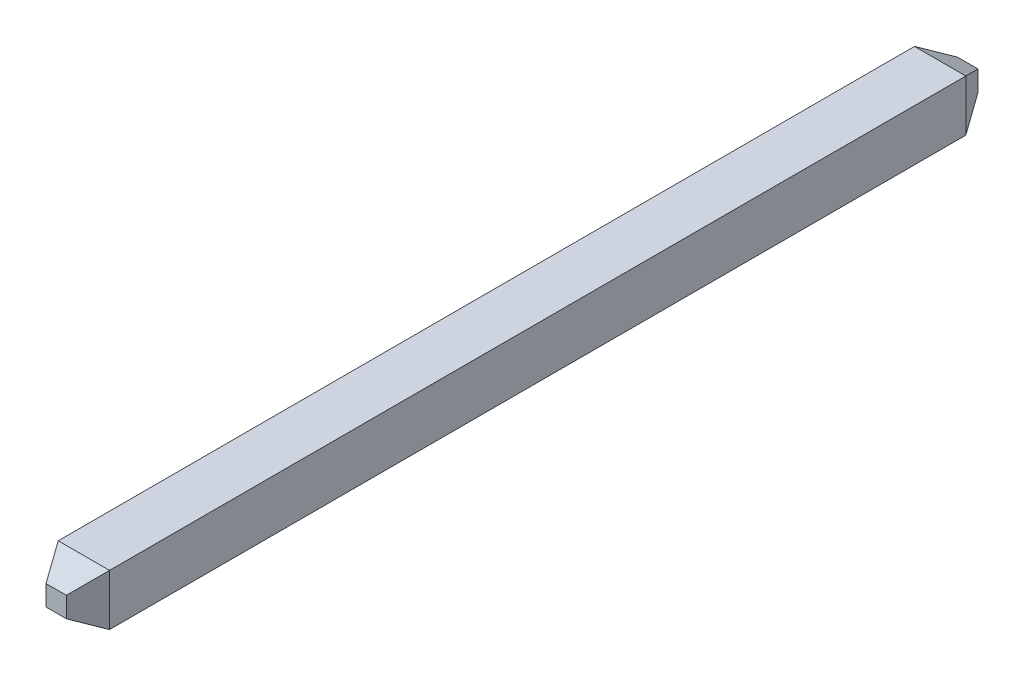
from build123d import *
from OCP.BRepFilletAPI import BRepFilletAPI_MakeChamfer

# Parameters (mm, degrees)
SKETCH1_W           = 0.630214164
SKETCH1_H           = 11.2
BOSS_EXTRUDE1_DEPTH = 0.315
CHAMFER1_SIZE       = 0.19
CHAMFER1_SIZE2      = 0.339999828


with BuildPart() as part:
    # Sketch1 → Boss-Extrude1 (new, symmetric)
    with BuildSketch(Plane(origin=(0, 0, 0), x_dir=(1, 0, 0), z_dir=(0, 1, 0))):
        Rectangle(SKETCH1_W, SKETCH1_H)
    extrude(amount=BOSS_EXTRUDE1_DEPTH, both=True)

    # Chamfer1: one chamfer whose edges measure the first distance from different faces: ONE call of the kernel's chamfer builder (chamfer() names one face for all edges)
    chamfer1_edges_1 = [part.edges().sort_by_distance(p)[0] for p in [
        (0, -0.315, 5.6),
        (0, 0.315, 5.6),
        (0.315107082, 0, 5.6),
        (-0.315107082, 0, 5.6),
    ]]
    chamfer1_side_1 = [part.faces().sort_by_distance(p)[0] for p in [
        (0, 0, 5.6),
    ]]
    chamfer1_edges_2 = [part.edges().sort_by_distance(p)[0] for p in [
        (0, 0.315, -5.6),
        (0, -0.315, -5.6),
        (-0.315107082, 0, -5.6),
        (0.315107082, 0, -5.6),
    ]]
    chamfer1_side_2 = [part.faces().sort_by_distance(p)[0] for p in [
        (0, 0, -5.6),
    ]]
    chamfer1 = BRepFilletAPI_MakeChamfer(part.part.solid().wrapped)
    for e in chamfer1_edges_1:
        chamfer1.Add(CHAMFER1_SIZE, CHAMFER1_SIZE2, e.wrapped, chamfer1_side_1[0].wrapped)  # the first distance lies on this face
    for e in chamfer1_edges_2:
        chamfer1.Add(CHAMFER1_SIZE, CHAMFER1_SIZE2, e.wrapped, chamfer1_side_2[0].wrapped)  # the first distance lies on this face
    add(Compound.cast(chamfer1.Shape()), mode=Mode.REPLACE)


solid = part.part
